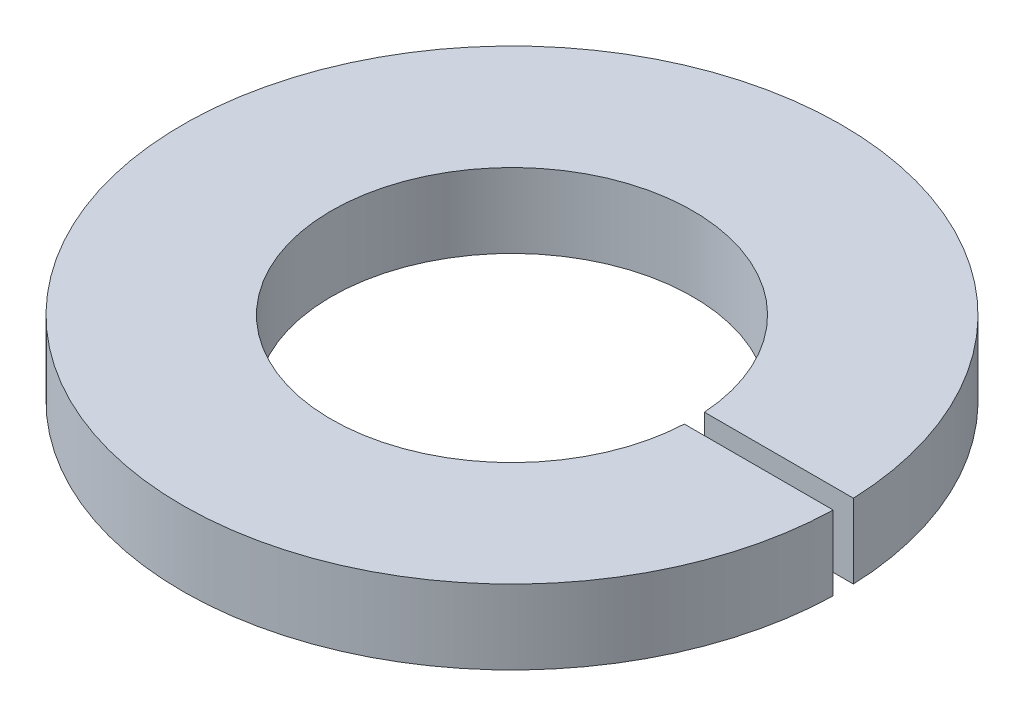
from build123d import *

# Parameters (mm, degrees)
SKETCH1_R          = 3.1
EXTRUDE1_DEPTH     = 0.7
SKETCH2_R          = 1.7
CUT_EXTRUDE1_DEPTH = 5.439594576
SKETCH3_W          = 1.509479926
SKETCH3_H          = 0.191482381
CUT_EXTRUDE3_DEPTH = 5.439594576


with BuildPart() as part:
    # Sketch1 → Extrude1 (new body)
    with BuildSketch(Plane(origin=(0, 0, 0), x_dir=(1, 0, 0), z_dir=(0, 1, 0))):
        with Locations(Location((0, 0, 0), (0, 0, 270))):
            Circle(SKETCH1_R)
    extrude(amount=EXTRUDE1_DEPTH)

    # Sketch2 → Cut-Extrude1 (cut, through all)
    with BuildSketch(Plane(origin=(0, 0.7, 0), x_dir=(1, 0, 0), z_dir=(0, 1, 0))):
        with Locations(Location((0, 0, 0), (0, 0, 270))):
            Circle(SKETCH2_R)
    extrude(amount=-CUT_EXTRUDE1_DEPTH, mode=Mode.SUBTRACT)

    # Sketch3 → Cut-Extrude3 (cut, through all)
    with BuildSketch(Plane(origin=(0, 0.7, 0), x_dir=(1, 0, 0), z_dir=(0, 1, 0))):
        with Locations((2.450921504, 0.018136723)):
            Rectangle(SKETCH3_W, SKETCH3_H)
    extrude(amount=-CUT_EXTRUDE3_DEPTH, mode=Mode.SUBTRACT)


solid = part.part
